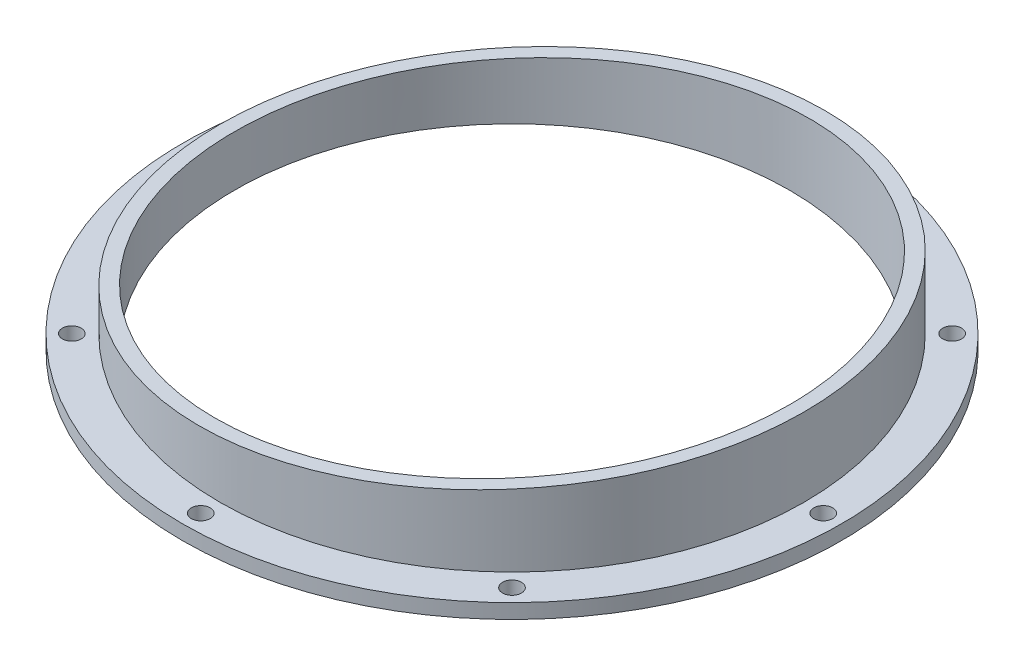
ISO-10303-21;
HEADER;
FILE_DESCRIPTION(('STEP AP214'),'2;1');
FILE_NAME('part.step','',(''),(''),'','','');
FILE_SCHEMA(('AUTOMOTIVE_DESIGN { 1 0 10303 214 1 1 1 1 }'));
ENDSEC;
DATA;
#1=APPLICATION_CONTEXT('core data for automotive mechanical design processes');
#2=APPLICATION_PROTOCOL_DEFINITION('international standard','automotive_design',2000,#1);
#3=PRODUCT_CONTEXT('',#1,'mechanical');
#4=PRODUCT('Part','Part','',(#3));
#5=PRODUCT_RELATED_PRODUCT_CATEGORY('part','',(#4));
#6=PRODUCT_DEFINITION_FORMATION('','',#4);
#7=PRODUCT_DEFINITION_CONTEXT('part definition',#1,'design');
#8=PRODUCT_DEFINITION('design','',#6,#7);
#9=PRODUCT_DEFINITION_SHAPE('','',#8);
#10=(LENGTH_UNIT() NAMED_UNIT(*) SI_UNIT(.MILLI.,.METRE.));
#11=(NAMED_UNIT(*) PLANE_ANGLE_UNIT() SI_UNIT($,.RADIAN.));
#12=(NAMED_UNIT(*) SI_UNIT($,.STERADIAN.) SOLID_ANGLE_UNIT());
#13=UNCERTAINTY_MEASURE_WITH_UNIT(LENGTH_MEASURE(1.E-05),#10,'distance_accuracy_value','');
#14=(GEOMETRIC_REPRESENTATION_CONTEXT(3) GLOBAL_UNCERTAINTY_ASSIGNED_CONTEXT((#13)) GLOBAL_UNIT_ASSIGNED_CONTEXT((#10,
#11,#12)) REPRESENTATION_CONTEXT('',''));
#15=CARTESIAN_POINT('',(0.,0.,0.));
#16=DIRECTION('',(0.,0.,1.));
#17=DIRECTION('',(1.,0.,0.));
#18=AXIS2_PLACEMENT_3D('',#15,#16,#17);
#19=CARTESIAN_POINT('',(0.,25.4,0.));
#20=DIRECTION('',(0.,-1.,0.));
#21=DIRECTION('',(0.,0.,-1.));
#22=AXIS2_PLACEMENT_3D('',#19,#20,#21);
#23=CYLINDRICAL_SURFACE('',#22,50.673);
#24=CARTESIAN_POINT('',(0.,9.81846894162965,0.));
#25=DIRECTION('',(0.0737603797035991,-0.997275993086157,0.));
#26=DIRECTION('',(-0.997275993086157,-0.0737603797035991,0.));
#27=AXIS2_PLACEMENT_3D('',#24,#25,#26);
#28=ELLIPSE('',#27,50.8114106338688,50.673);
#29=CARTESIAN_POINT('',(-50.673,6.0706,0.));
#30=VERTEX_POINT('',#29);
#31=EDGE_CURVE('E53',#30,#30,#28,.T.);
#32=ORIENTED_EDGE('',*,*,#31,.T.);
#33=EDGE_LOOP('',(#32));
#34=FACE_BOUND('',#33,.T.);
#35=CARTESIAN_POINT('',(0.,0.,0.));
#36=DIRECTION('',(0.,-1.,0.));
#37=DIRECTION('',(0.,0.,-1.));
#38=AXIS2_PLACEMENT_3D('',#35,#36,#37);
#39=CIRCLE('',#38,50.673);
#40=CARTESIAN_POINT('',(0.,0.,-50.673));
#41=VERTEX_POINT('',#40);
#42=EDGE_CURVE('E10',#41,#41,#39,.T.);
#43=ORIENTED_EDGE('',*,*,#42,.F.);
#44=EDGE_LOOP('',(#43));
#45=FACE_BOUND('',#44,.T.);
#46=ADVANCED_FACE('F34',(#34,#45),#23,.T.);
#47=CARTESIAN_POINT('',(0.,0.,0.));
#48=DIRECTION('',(0.,-1.,0.));
#49=DIRECTION('',(0.,0.,-1.));
#50=AXIS2_PLACEMENT_3D('',#47,#48,#49);
#51=PLANE('',#50);
#52=CARTESIAN_POINT('',(-38.1660885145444,0.,-38.1660885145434));
#53=DIRECTION('',(0.,-1.,0.));
#54=DIRECTION('',(0.,0.,-1.));
#55=AXIS2_PLACEMENT_3D('',#52,#53,#54);
#56=CIRCLE('',#55,1.63195);
#57=CARTESIAN_POINT('',(-38.1660885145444,0.,-39.7980385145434));
#58=VERTEX_POINT('',#57);
#59=EDGE_CURVE('E98',#58,#58,#56,.T.);
#60=ORIENTED_EDGE('',*,*,#59,.T.);
#61=EDGE_LOOP('',(#60));
#62=FACE_BOUND('',#61,.T.);
#63=CARTESIAN_POINT('',(-5.65358443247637E-13,0.,-53.975));
#64=DIRECTION('',(0.,-1.,0.));
#65=DIRECTION('',(0.,0.,-1.));
#66=AXIS2_PLACEMENT_3D('',#63,#64,#65);
#67=CIRCLE('',#66,1.63195);
#68=CARTESIAN_POINT('',(-5.65358443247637E-13,0.,-55.60695));
#69=VERTEX_POINT('',#68);
#70=EDGE_CURVE('E92',#69,#69,#67,.T.);
#71=ORIENTED_EDGE('',*,*,#70,.T.);
#72=EDGE_LOOP('',(#71));
#73=FACE_BOUND('',#72,.T.);
#74=CARTESIAN_POINT('',(38.1660885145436,0.,-38.1660885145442));
#75=DIRECTION('',(0.,-1.,0.));
#76=DIRECTION('',(0.,0.,-1.));
#77=AXIS2_PLACEMENT_3D('',#74,#75,#76);
#78=CIRCLE('',#77,1.63195);
#79=CARTESIAN_POINT('',(38.1660885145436,0.,-39.7980385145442));
#80=VERTEX_POINT('',#79);
#81=EDGE_CURVE('E86',#80,#80,#78,.T.);
#82=ORIENTED_EDGE('',*,*,#81,.T.);
#83=EDGE_LOOP('',(#82));
#84=FACE_BOUND('',#83,.T.);
#85=CARTESIAN_POINT('',(53.975,0.,-3.76905628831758E-13));
#86=DIRECTION('',(0.,-1.,0.));
#87=DIRECTION('',(0.,0.,-1.));
#88=AXIS2_PLACEMENT_3D('',#85,#86,#87);
#89=CIRCLE('',#88,1.63195);
#90=CARTESIAN_POINT('',(53.975,0.,-1.63195000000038));
#91=VERTEX_POINT('',#90);
#92=EDGE_CURVE('E80',#91,#91,#89,.T.);
#93=ORIENTED_EDGE('',*,*,#92,.T.);
#94=EDGE_LOOP('',(#93));
#95=FACE_BOUND('',#94,.T.);
#96=CARTESIAN_POINT('',(38.1660885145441,0.,38.1660885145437));
#97=DIRECTION('',(0.,-1.,0.));
#98=DIRECTION('',(0.,0.,-1.));
#99=AXIS2_PLACEMENT_3D('',#96,#97,#98);
#100=CIRCLE('',#99,1.63195);
#101=CARTESIAN_POINT('',(38.1660885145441,0.,36.5341385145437));
#102=VERTEX_POINT('',#101);
#103=EDGE_CURVE('E74',#102,#102,#100,.T.);
#104=ORIENTED_EDGE('',*,*,#103,.T.);
#105=EDGE_LOOP('',(#104));
#106=FACE_BOUND('',#105,.T.);
#107=CARTESIAN_POINT('',(1.88452814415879E-13,0.,53.975));
#108=DIRECTION('',(0.,-1.,0.));
#109=DIRECTION('',(0.,0.,-1.));
#110=AXIS2_PLACEMENT_3D('',#107,#108,#109);
#111=CIRCLE('',#110,1.63195);
#112=CARTESIAN_POINT('',(1.88452814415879E-13,0.,52.34305));
#113=VERTEX_POINT('',#112);
#114=EDGE_CURVE('E68',#113,#113,#111,.T.);
#115=ORIENTED_EDGE('',*,*,#114,.T.);
#116=EDGE_LOOP('',(#115));
#117=FACE_BOUND('',#116,.T.);
#118=CARTESIAN_POINT('',(-38.1660885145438,0.,38.166088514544));
#119=DIRECTION('',(0.,-1.,0.));
#120=DIRECTION('',(0.,0.,-1.));
#121=AXIS2_PLACEMENT_3D('',#118,#119,#120);
#122=CIRCLE('',#121,1.63195);
#123=CARTESIAN_POINT('',(-38.1660885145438,0.,36.534138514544));
#124=VERTEX_POINT('',#123);
#125=EDGE_CURVE('E62',#124,#124,#122,.T.);
#126=ORIENTED_EDGE('',*,*,#125,.T.);
#127=EDGE_LOOP('',(#126));
#128=FACE_BOUND('',#127,.T.);
#129=CARTESIAN_POINT('',(-53.975,0.,0.));
#130=DIRECTION('',(0.,-1.,0.));
#131=DIRECTION('',(0.,0.,-1.));
#132=AXIS2_PLACEMENT_3D('',#129,#130,#131);
#133=CIRCLE('',#132,1.63195);
#134=CARTESIAN_POINT('',(-53.975,0.,-1.63195));
#135=VERTEX_POINT('',#134);
#136=EDGE_CURVE('E56',#135,#135,#133,.T.);
#137=ORIENTED_EDGE('',*,*,#136,.T.);
#138=EDGE_LOOP('',(#137));
#139=FACE_BOUND('',#138,.T.);
#140=CARTESIAN_POINT('',(0.,0.,0.));
#141=DIRECTION('',(0.,-1.,0.));
#142=DIRECTION('',(0.,0.,-1.));
#143=AXIS2_PLACEMENT_3D('',#140,#141,#142);
#144=CIRCLE('',#143,57.15);
#145=CARTESIAN_POINT('',(0.,0.,-57.15));
#146=VERTEX_POINT('',#145);
#147=EDGE_CURVE('E45',#146,#146,#144,.T.);
#148=ORIENTED_EDGE('',*,*,#147,.F.);
#149=EDGE_LOOP('',(#148));
#150=FACE_BOUND('',#149,.T.);
#151=ORIENTED_EDGE('',*,*,#42,.T.);
#152=EDGE_LOOP('',(#151));
#153=FACE_BOUND('',#152,.T.);
#154=ADVANCED_FACE('F134',(#62,#73,#84,#95,#106,#117,#128,#139,#150,#153),#51,.F.);
#155=CARTESIAN_POINT('',(0.,-2.54,0.));
#156=DIRECTION('',(0.,1.,0.));
#157=DIRECTION('',(0.,0.,1.));
#158=AXIS2_PLACEMENT_3D('',#155,#156,#157);
#159=CYLINDRICAL_SURFACE('',#158,57.15);
#160=CARTESIAN_POINT('',(0.,-2.54,0.));
#161=DIRECTION('',(0.,-1.,0.));
#162=DIRECTION('',(0.,0.,-1.));
#163=AXIS2_PLACEMENT_3D('',#160,#161,#162);
#164=CIRCLE('',#163,57.15);
#165=CARTESIAN_POINT('',(0.,-2.54,-57.15));
#166=VERTEX_POINT('',#165);
#167=EDGE_CURVE('E41',#166,#166,#164,.T.);
#168=ORIENTED_EDGE('',*,*,#167,.F.);
#169=EDGE_LOOP('',(#168));
#170=FACE_BOUND('',#169,.T.);
#171=ORIENTED_EDGE('',*,*,#147,.T.);
#172=EDGE_LOOP('',(#171));
#173=FACE_BOUND('',#172,.T.);
#174=ADVANCED_FACE('F112',(#170,#173),#159,.T.);
#175=CARTESIAN_POINT('',(0.,-2.54,0.));
#176=DIRECTION('',(0.,-1.,0.));
#177=DIRECTION('',(0.,0.,-1.));
#178=AXIS2_PLACEMENT_3D('',#175,#176,#177);
#179=PLANE('',#178);
#180=CARTESIAN_POINT('',(-38.1660885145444,-2.54,-38.1660885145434));
#181=DIRECTION('',(0.,-1.,0.));
#182=DIRECTION('',(0.,0.,-1.));
#183=AXIS2_PLACEMENT_3D('',#180,#181,#182);
#184=CIRCLE('',#183,1.63195);
#185=CARTESIAN_POINT('',(-38.1660885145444,-2.54,-39.7980385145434));
#186=VERTEX_POINT('',#185);
#187=EDGE_CURVE('E101',#186,#186,#184,.T.);
#188=ORIENTED_EDGE('',*,*,#187,.F.);
#189=EDGE_LOOP('',(#188));
#190=FACE_BOUND('',#189,.T.);
#191=CARTESIAN_POINT('',(-5.65358443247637E-13,-2.54,-53.975));
#192=DIRECTION('',(0.,-1.,0.));
#193=DIRECTION('',(0.,0.,-1.));
#194=AXIS2_PLACEMENT_3D('',#191,#192,#193);
#195=CIRCLE('',#194,1.63195);
#196=CARTESIAN_POINT('',(-5.65358443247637E-13,-2.54,-55.60695));
#197=VERTEX_POINT('',#196);
#198=EDGE_CURVE('E95',#197,#197,#195,.T.);
#199=ORIENTED_EDGE('',*,*,#198,.F.);
#200=EDGE_LOOP('',(#199));
#201=FACE_BOUND('',#200,.T.);
#202=CARTESIAN_POINT('',(38.1660885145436,-2.54,-38.1660885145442));
#203=DIRECTION('',(0.,-1.,0.));
#204=DIRECTION('',(0.,0.,-1.));
#205=AXIS2_PLACEMENT_3D('',#202,#203,#204);
#206=CIRCLE('',#205,1.63195);
#207=CARTESIAN_POINT('',(38.1660885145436,-2.54,-39.7980385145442));
#208=VERTEX_POINT('',#207);
#209=EDGE_CURVE('E89',#208,#208,#206,.T.);
#210=ORIENTED_EDGE('',*,*,#209,.F.);
#211=EDGE_LOOP('',(#210));
#212=FACE_BOUND('',#211,.T.);
#213=CARTESIAN_POINT('',(53.975,-2.54,-3.76905628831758E-13));
#214=DIRECTION('',(0.,-1.,0.));
#215=DIRECTION('',(0.,0.,-1.));
#216=AXIS2_PLACEMENT_3D('',#213,#214,#215);
#217=CIRCLE('',#216,1.63195);
#218=CARTESIAN_POINT('',(53.975,-2.54,-1.63195000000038));
#219=VERTEX_POINT('',#218);
#220=EDGE_CURVE('E83',#219,#219,#217,.T.);
#221=ORIENTED_EDGE('',*,*,#220,.F.);
#222=EDGE_LOOP('',(#221));
#223=FACE_BOUND('',#222,.T.);
#224=CARTESIAN_POINT('',(38.1660885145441,-2.54,38.1660885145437));
#225=DIRECTION('',(0.,-1.,0.));
#226=DIRECTION('',(0.,0.,-1.));
#227=AXIS2_PLACEMENT_3D('',#224,#225,#226);
#228=CIRCLE('',#227,1.63195);
#229=CARTESIAN_POINT('',(38.1660885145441,-2.54,36.5341385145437));
#230=VERTEX_POINT('',#229);
#231=EDGE_CURVE('E77',#230,#230,#228,.T.);
#232=ORIENTED_EDGE('',*,*,#231,.F.);
#233=EDGE_LOOP('',(#232));
#234=FACE_BOUND('',#233,.T.);
#235=CARTESIAN_POINT('',(1.88452814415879E-13,-2.54,53.975));
#236=DIRECTION('',(0.,-1.,0.));
#237=DIRECTION('',(0.,0.,-1.));
#238=AXIS2_PLACEMENT_3D('',#235,#236,#237);
#239=CIRCLE('',#238,1.63195);
#240=CARTESIAN_POINT('',(1.88452814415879E-13,-2.54,52.34305));
#241=VERTEX_POINT('',#240);
#242=EDGE_CURVE('E71',#241,#241,#239,.T.);
#243=ORIENTED_EDGE('',*,*,#242,.F.);
#244=EDGE_LOOP('',(#243));
#245=FACE_BOUND('',#244,.T.);
#246=CARTESIAN_POINT('',(-38.1660885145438,-2.54,38.166088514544));
#247=DIRECTION('',(0.,-1.,0.));
#248=DIRECTION('',(0.,0.,-1.));
#249=AXIS2_PLACEMENT_3D('',#246,#247,#248);
#250=CIRCLE('',#249,1.63195);
#251=CARTESIAN_POINT('',(-38.1660885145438,-2.54,36.534138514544));
#252=VERTEX_POINT('',#251);
#253=EDGE_CURVE('E65',#252,#252,#250,.T.);
#254=ORIENTED_EDGE('',*,*,#253,.F.);
#255=EDGE_LOOP('',(#254));
#256=FACE_BOUND('',#255,.T.);
#257=CARTESIAN_POINT('',(-53.975,-2.54,0.));
#258=DIRECTION('',(0.,-1.,0.));
#259=DIRECTION('',(0.,0.,-1.));
#260=AXIS2_PLACEMENT_3D('',#257,#258,#259);
#261=CIRCLE('',#260,1.63195);
#262=CARTESIAN_POINT('',(-53.975,-2.54,-1.63195));
#263=VERTEX_POINT('',#262);
#264=EDGE_CURVE('E59',#263,#263,#261,.T.);
#265=ORIENTED_EDGE('',*,*,#264,.F.);
#266=EDGE_LOOP('',(#265));
#267=FACE_BOUND('',#266,.T.);
#268=CARTESIAN_POINT('',(0.,-2.54,0.));
#269=DIRECTION('',(0.,1.,0.));
#270=DIRECTION('',(0.,0.,1.));
#271=AXIS2_PLACEMENT_3D('',#268,#269,#270);
#272=CIRCLE('',#271,48.133);
#273=CARTESIAN_POINT('',(0.,-2.54,48.133));
#274=VERTEX_POINT('',#273);
#275=EDGE_CURVE('E49',#274,#274,#272,.T.);
#276=ORIENTED_EDGE('',*,*,#275,.T.);
#277=EDGE_LOOP('',(#276));
#278=FACE_BOUND('',#277,.T.);
#279=ORIENTED_EDGE('',*,*,#167,.T.);
#280=EDGE_LOOP('',(#279));
#281=FACE_BOUND('',#280,.T.);
#282=ADVANCED_FACE('F108',(#190,#201,#212,#223,#234,#245,#256,#267,#278,#281),#179,.T.);
#283=CARTESIAN_POINT('',(0.,-2.54,0.));
#284=DIRECTION('',(0.,1.,0.));
#285=DIRECTION('',(0.,0.,1.));
#286=AXIS2_PLACEMENT_3D('',#283,#284,#285);
#287=CYLINDRICAL_SURFACE('',#286,48.133);
#288=CARTESIAN_POINT('',(0.,9.81846894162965,0.));
#289=DIRECTION('',(0.0737603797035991,-0.997275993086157,0.));
#290=DIRECTION('',(0.997275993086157,0.0737603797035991,0.));
#291=AXIS2_PLACEMENT_3D('',#288,#289,#290);
#292=ELLIPSE('',#291,48.2644727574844,48.133);
#293=CARTESIAN_POINT('',(48.133,13.3784747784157,0.));
#294=VERTEX_POINT('',#293);
#295=EDGE_CURVE('E37',#294,#294,#292,.F.);
#296=ORIENTED_EDGE('',*,*,#295,.T.);
#297=EDGE_LOOP('',(#296));
#298=FACE_BOUND('',#297,.T.);
#299=ORIENTED_EDGE('',*,*,#275,.F.);
#300=EDGE_LOOP('',(#299));
#301=FACE_BOUND('',#300,.T.);
#302=ADVANCED_FACE('F111',(#298,#301),#287,.F.);
#303=CARTESIAN_POINT('',(50.673,13.5663378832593,268.393162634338));
#304=DIRECTION('',(0.0737603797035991,-0.997275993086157,0.));
#305=DIRECTION('',(0.997275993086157,0.0737603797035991,0.));
#306=AXIS2_PLACEMENT_3D('',#303,#304,#305);
#307=PLANE('',#306);
#308=ORIENTED_EDGE('',*,*,#295,.F.);
#309=EDGE_LOOP('',(#308));
#310=FACE_BOUND('',#309,.T.);
#311=ORIENTED_EDGE('',*,*,#31,.F.);
#312=EDGE_LOOP('',(#311));
#313=FACE_BOUND('',#312,.T.);
#314=ADVANCED_FACE('F148',(#310,#313),#307,.F.);
#315=CARTESIAN_POINT('',(-53.975,-2.54,0.));
#316=DIRECTION('',(0.,-1.,0.));
#317=DIRECTION('',(0.,0.,-1.));
#318=AXIS2_PLACEMENT_3D('',#315,#316,#317);
#319=CYLINDRICAL_SURFACE('',#318,1.63195);
#320=ORIENTED_EDGE('',*,*,#264,.T.);
#321=EDGE_LOOP('',(#320));
#322=FACE_BOUND('',#321,.T.);
#323=ORIENTED_EDGE('',*,*,#136,.F.);
#324=EDGE_LOOP('',(#323));
#325=FACE_BOUND('',#324,.T.);
#326=ADVANCED_FACE('F152',(#322,#325),#319,.F.);
#327=CARTESIAN_POINT('',(-38.1660885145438,-2.54,38.166088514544));
#328=DIRECTION('',(0.,-1.,0.));
#329=DIRECTION('',(0.,0.,-1.));
#330=AXIS2_PLACEMENT_3D('',#327,#328,#329);
#331=CYLINDRICAL_SURFACE('',#330,1.63195);
#332=ORIENTED_EDGE('',*,*,#253,.T.);
#333=EDGE_LOOP('',(#332));
#334=FACE_BOUND('',#333,.T.);
#335=ORIENTED_EDGE('',*,*,#125,.F.);
#336=EDGE_LOOP('',(#335));
#337=FACE_BOUND('',#336,.T.);
#338=ADVANCED_FACE('F156',(#334,#337),#331,.F.);
#339=CARTESIAN_POINT('',(1.88452814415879E-13,-2.54,53.975));
#340=DIRECTION('',(0.,-1.,0.));
#341=DIRECTION('',(0.,0.,-1.));
#342=AXIS2_PLACEMENT_3D('',#339,#340,#341);
#343=CYLINDRICAL_SURFACE('',#342,1.63195);
#344=ORIENTED_EDGE('',*,*,#242,.T.);
#345=EDGE_LOOP('',(#344));
#346=FACE_BOUND('',#345,.T.);
#347=ORIENTED_EDGE('',*,*,#114,.F.);
#348=EDGE_LOOP('',(#347));
#349=FACE_BOUND('',#348,.T.);
#350=ADVANCED_FACE('F160',(#346,#349),#343,.F.);
#351=CARTESIAN_POINT('',(38.1660885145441,-2.54,38.1660885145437));
#352=DIRECTION('',(0.,-1.,0.));
#353=DIRECTION('',(0.,0.,-1.));
#354=AXIS2_PLACEMENT_3D('',#351,#352,#353);
#355=CYLINDRICAL_SURFACE('',#354,1.63195);
#356=ORIENTED_EDGE('',*,*,#231,.T.);
#357=EDGE_LOOP('',(#356));
#358=FACE_BOUND('',#357,.T.);
#359=ORIENTED_EDGE('',*,*,#103,.F.);
#360=EDGE_LOOP('',(#359));
#361=FACE_BOUND('',#360,.T.);
#362=ADVANCED_FACE('F164',(#358,#361),#355,.F.);
#363=CARTESIAN_POINT('',(53.975,-2.54,-3.76905628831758E-13));
#364=DIRECTION('',(0.,-1.,0.));
#365=DIRECTION('',(0.,0.,-1.));
#366=AXIS2_PLACEMENT_3D('',#363,#364,#365);
#367=CYLINDRICAL_SURFACE('',#366,1.63195);
#368=ORIENTED_EDGE('',*,*,#220,.T.);
#369=EDGE_LOOP('',(#368));
#370=FACE_BOUND('',#369,.T.);
#371=ORIENTED_EDGE('',*,*,#92,.F.);
#372=EDGE_LOOP('',(#371));
#373=FACE_BOUND('',#372,.T.);
#374=ADVANCED_FACE('F168',(#370,#373),#367,.F.);
#375=CARTESIAN_POINT('',(38.1660885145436,-2.54,-38.1660885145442));
#376=DIRECTION('',(0.,-1.,0.));
#377=DIRECTION('',(0.,0.,-1.));
#378=AXIS2_PLACEMENT_3D('',#375,#376,#377);
#379=CYLINDRICAL_SURFACE('',#378,1.63195);
#380=ORIENTED_EDGE('',*,*,#209,.T.);
#381=EDGE_LOOP('',(#380));
#382=FACE_BOUND('',#381,.T.);
#383=ORIENTED_EDGE('',*,*,#81,.F.);
#384=EDGE_LOOP('',(#383));
#385=FACE_BOUND('',#384,.T.);
#386=ADVANCED_FACE('F172',(#382,#385),#379,.F.);
#387=CARTESIAN_POINT('',(-5.65358443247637E-13,-2.54,-53.975));
#388=DIRECTION('',(0.,-1.,0.));
#389=DIRECTION('',(0.,0.,-1.));
#390=AXIS2_PLACEMENT_3D('',#387,#388,#389);
#391=CYLINDRICAL_SURFACE('',#390,1.63195);
#392=ORIENTED_EDGE('',*,*,#198,.T.);
#393=EDGE_LOOP('',(#392));
#394=FACE_BOUND('',#393,.T.);
#395=ORIENTED_EDGE('',*,*,#70,.F.);
#396=EDGE_LOOP('',(#395));
#397=FACE_BOUND('',#396,.T.);
#398=ADVANCED_FACE('F176',(#394,#397),#391,.F.);
#399=CARTESIAN_POINT('',(-38.1660885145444,-2.54,-38.1660885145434));
#400=DIRECTION('',(0.,-1.,0.));
#401=DIRECTION('',(0.,0.,-1.));
#402=AXIS2_PLACEMENT_3D('',#399,#400,#401);
#403=CYLINDRICAL_SURFACE('',#402,1.63195);
#404=ORIENTED_EDGE('',*,*,#187,.T.);
#405=EDGE_LOOP('',(#404));
#406=FACE_BOUND('',#405,.T.);
#407=ORIENTED_EDGE('',*,*,#59,.F.);
#408=EDGE_LOOP('',(#407));
#409=FACE_BOUND('',#408,.T.);
#410=ADVANCED_FACE('F105',(#406,#409),#403,.F.);
#411=CLOSED_SHELL('',(#46,#154,#174,#282,#302,#314,#326,#338,#350,#362,#374,#386,#398,#410));
#412=MANIFOLD_SOLID_BREP('B2',#411);
#413=ADVANCED_BREP_SHAPE_REPRESENTATION('',(#18,#412),#14);
#414=SHAPE_DEFINITION_REPRESENTATION(#9,#413);
ENDSEC;
END-ISO-10303-21;
